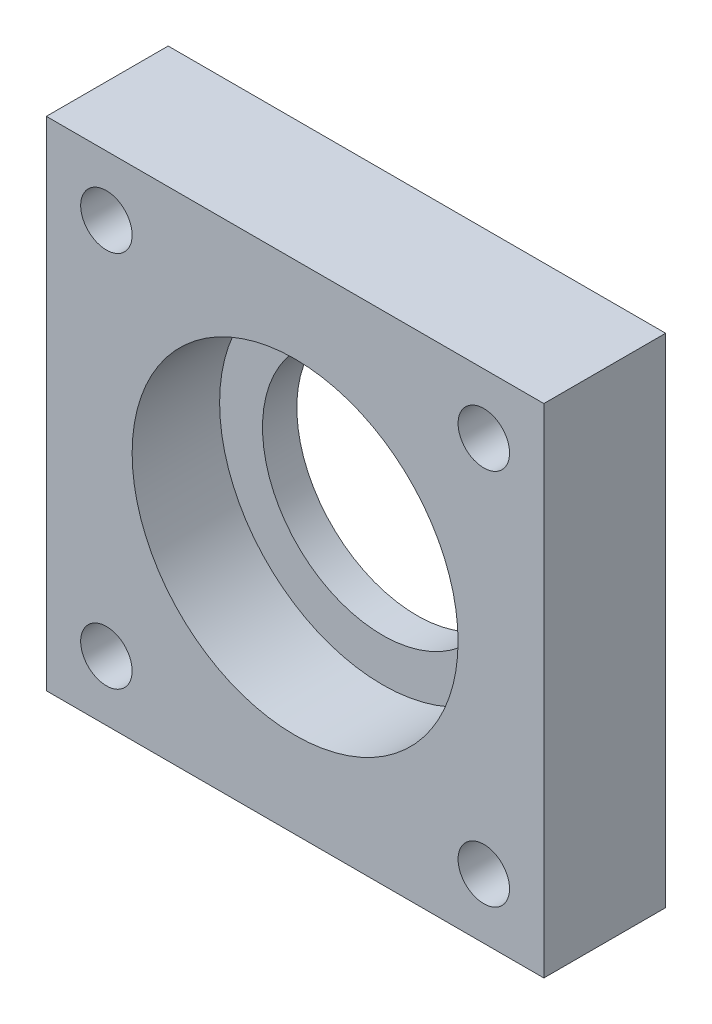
ISO-10303-21;
HEADER;
FILE_DESCRIPTION(('STEP AP214'),'2;1');
FILE_NAME('part.step','',(''),(''),'','','');
FILE_SCHEMA(('AUTOMOTIVE_DESIGN { 1 0 10303 214 1 1 1 1 }'));
ENDSEC;
DATA;
#1=APPLICATION_CONTEXT('core data for automotive mechanical design processes');
#2=APPLICATION_PROTOCOL_DEFINITION('international standard','automotive_design',2000,#1);
#3=PRODUCT_CONTEXT('',#1,'mechanical');
#4=PRODUCT('Part','Part','',(#3));
#5=PRODUCT_RELATED_PRODUCT_CATEGORY('part','',(#4));
#6=PRODUCT_DEFINITION_FORMATION('','',#4);
#7=PRODUCT_DEFINITION_CONTEXT('part definition',#1,'design');
#8=PRODUCT_DEFINITION('design','',#6,#7);
#9=PRODUCT_DEFINITION_SHAPE('','',#8);
#10=(LENGTH_UNIT() NAMED_UNIT(*) SI_UNIT(.MILLI.,.METRE.));
#11=(NAMED_UNIT(*) PLANE_ANGLE_UNIT() SI_UNIT($,.RADIAN.));
#12=(NAMED_UNIT(*) SI_UNIT($,.STERADIAN.) SOLID_ANGLE_UNIT());
#13=UNCERTAINTY_MEASURE_WITH_UNIT(LENGTH_MEASURE(1.E-05),#10,'distance_accuracy_value','');
#14=(GEOMETRIC_REPRESENTATION_CONTEXT(3) GLOBAL_UNCERTAINTY_ASSIGNED_CONTEXT((#13)) GLOBAL_UNIT_ASSIGNED_CONTEXT((#10,
#11,#12)) REPRESENTATION_CONTEXT('',''));
#15=CARTESIAN_POINT('',(0.,0.,0.));
#16=DIRECTION('',(0.,0.,1.));
#17=DIRECTION('',(1.,0.,0.));
#18=AXIS2_PLACEMENT_3D('',#15,#16,#17);
#19=CARTESIAN_POINT('',(0.,0.,-2.));
#20=DIRECTION('',(0.,0.,1.));
#21=DIRECTION('',(1.,0.,0.));
#22=AXIS2_PLACEMENT_3D('',#19,#20,#21);
#23=PLANE('',#22);
#24=DIRECTION('',(-0.918032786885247,0.396504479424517,0.));
#25=VECTOR('',#24,1.);
#26=CARTESIAN_POINT('',(-7.7233418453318,-17.8819695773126,-2.));
#27=LINE('',#26,#25);
#28=CARTESIAN_POINT('',(-15.8231617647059,-14.3836033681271,-2.));
#29=VERTEX_POINT('',#28);
#30=CARTESIAN_POINT('',(-18.6231617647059,-13.1742647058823,-2.));
#31=VERTEX_POINT('',#30);
#32=EDGE_CURVE('E58',#29,#31,#27,.T.);
#33=ORIENTED_EDGE('',*,*,#32,.T.);
#34=DIRECTION('',(-0.918032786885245,-0.396504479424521,0.));
#35=VECTOR('',#34,1.);
#36=CARTESIAN_POINT('',(1.86763121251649,-4.32415464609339,-2.));
#37=LINE('',#36,#35);
#38=CARTESIAN_POINT('',(-21.4231617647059,-14.3836033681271,-2.));
#39=VERTEX_POINT('',#38);
#40=EDGE_CURVE('E287',#31,#39,#37,.T.);
#41=ORIENTED_EDGE('',*,*,#40,.T.);
#42=DIRECTION('',(0.,-1.,0.));
#43=VECTOR('',#42,1.);
#44=CARTESIAN_POINT('',(-21.4231617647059,0.,-2.));
#45=LINE('',#44,#43);
#46=CARTESIAN_POINT('',(-21.4231617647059,-18.0649260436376,-2.));
#47=VERTEX_POINT('',#46);
#48=EDGE_CURVE('E315',#39,#47,#45,.T.);
#49=ORIENTED_EDGE('',*,*,#48,.T.);
#50=DIRECTION('',(-0.918032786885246,0.39650447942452,0.));
#51=VECTOR('',#50,1.);
#52=CARTESIAN_POINT('',(-9.94376693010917,-23.02295318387,-2.));
#53=LINE('',#52,#51);
#54=CARTESIAN_POINT('',(-18.6231617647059,-19.2742647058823,-2.));
#55=VERTEX_POINT('',#54);
#56=EDGE_CURVE('E312',#55,#47,#53,.T.);
#57=ORIENTED_EDGE('',*,*,#56,.F.);
#58=DIRECTION('',(-0.918032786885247,-0.396504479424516,0.));
#59=VECTOR('',#58,1.);
#60=CARTESIAN_POINT('',(4.08805629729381,-9.46513825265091,-2.));
#61=LINE('',#60,#59);
#62=CARTESIAN_POINT('',(-15.8231617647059,-18.0649260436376,-2.));
#63=VERTEX_POINT('',#62);
#64=EDGE_CURVE('E309',#63,#55,#61,.T.);
#65=ORIENTED_EDGE('',*,*,#64,.F.);
#66=DIRECTION('',(0.,-1.,0.));
#67=VECTOR('',#66,1.);
#68=CARTESIAN_POINT('',(-15.8231617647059,0.,-2.));
#69=LINE('',#68,#67);
#70=EDGE_CURVE('E305',#29,#63,#69,.T.);
#71=ORIENTED_EDGE('',*,*,#70,.F.);
#72=EDGE_LOOP('',(#33,#41,#49,#57,#65,#71));
#73=FACE_BOUND('',#72,.T.);
#74=DIRECTION('',(-0.918032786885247,0.396504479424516,0.));
#75=VECTOR('',#74,1.);
#76=CARTESIAN_POINT('',(3.74349627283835,8.66737324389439,-2.));
#77=LINE('',#76,#75);
#78=CARTESIAN_POINT('',(6.176838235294,7.6163966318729,-2.));
#79=VERTEX_POINT('',#78);
#80=CARTESIAN_POINT('',(3.376838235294,8.82573529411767,-2.));
#81=VERTEX_POINT('',#80);
#82=EDGE_CURVE('E275',#79,#81,#77,.T.);
#83=ORIENTED_EDGE('',*,*,#82,.T.);
#84=DIRECTION('',(-0.918032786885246,-0.39650447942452,0.));
#85=VECTOR('',#84,1.);
#86=CARTESIAN_POINT('',(-2.68171160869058,6.20900723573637,-2.));
#87=LINE('',#86,#85);
#88=CARTESIAN_POINT('',(0.576838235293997,7.61639663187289,-2.));
#89=VERTEX_POINT('',#88);
#90=EDGE_CURVE('E380',#81,#89,#87,.T.);
#91=ORIENTED_EDGE('',*,*,#90,.T.);
#92=DIRECTION('',(0.,-1.,0.));
#93=VECTOR('',#92,1.);
#94=CARTESIAN_POINT('',(0.576838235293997,0.,-2.));
#95=LINE('',#94,#93);
#96=CARTESIAN_POINT('',(0.576838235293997,3.93507395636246,-2.));
#97=VERTEX_POINT('',#96);
#98=EDGE_CURVE('E408',#89,#97,#95,.T.);
#99=ORIENTED_EDGE('',*,*,#98,.T.);
#100=DIRECTION('',(-0.918032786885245,0.39650447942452,0.));
#101=VECTOR('',#100,1.);
#102=CARTESIAN_POINT('',(1.52307118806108,3.52638963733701,-2.));
#103=LINE('',#102,#101);
#104=CARTESIAN_POINT('',(3.37683823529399,2.72573529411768,-2.));
#105=VERTEX_POINT('',#104);
#106=EDGE_CURVE('E405',#105,#97,#103,.T.);
#107=ORIENTED_EDGE('',*,*,#106,.F.);
#108=DIRECTION('',(-0.918032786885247,-0.396504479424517,0.));
#109=VECTOR('',#108,1.);
#110=CARTESIAN_POINT('',(-0.461286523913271,1.06802362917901,-2.));
#111=LINE('',#110,#109);
#112=CARTESIAN_POINT('',(6.176838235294,3.93507395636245,-2.));
#113=VERTEX_POINT('',#112);
#114=EDGE_CURVE('E402',#113,#105,#111,.T.);
#115=ORIENTED_EDGE('',*,*,#114,.F.);
#116=DIRECTION('',(0.,-1.,0.));
#117=VECTOR('',#116,1.);
#118=CARTESIAN_POINT('',(6.176838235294,0.,-2.));
#119=LINE('',#118,#117);
#120=EDGE_CURVE('E399',#79,#113,#119,.T.);
#121=ORIENTED_EDGE('',*,*,#120,.F.);
#122=EDGE_LOOP('',(#83,#91,#99,#107,#115,#121));
#123=FACE_BOUND('',#122,.T.);
#124=DIRECTION('',(0.,-1.,0.));
#125=VECTOR('',#124,1.);
#126=CARTESIAN_POINT('',(6.87683823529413,0.,-2.));
#127=LINE('',#126,#125);
#128=CARTESIAN_POINT('',(6.87683823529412,9.27573529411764,-2.));
#129=VERTEX_POINT('',#128);
#130=CARTESIAN_POINT('',(6.87683823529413,-19.7242647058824,-2.));
#131=VERTEX_POINT('',#130);
#132=EDGE_CURVE('E439',#129,#131,#127,.T.);
#133=ORIENTED_EDGE('',*,*,#132,.T.);
#134=DIRECTION('',(1.,0.,0.));
#135=VECTOR('',#134,1.);
#136=CARTESIAN_POINT('',(0.,-19.7242647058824,-2.));
#137=LINE('',#136,#135);
#138=CARTESIAN_POINT('',(-22.1231617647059,-19.7242647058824,-2.));
#139=VERTEX_POINT('',#138);
#140=EDGE_CURVE('E448',#139,#131,#137,.T.);
#141=ORIENTED_EDGE('',*,*,#140,.F.);
#142=DIRECTION('',(0.,-1.,0.));
#143=VECTOR('',#142,1.);
#144=CARTESIAN_POINT('',(-22.1231617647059,0.,-2.));
#145=LINE('',#144,#143);
#146=CARTESIAN_POINT('',(-22.1231617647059,9.27573529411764,-2.));
#147=VERTEX_POINT('',#146);
#148=EDGE_CURVE('E445',#147,#139,#145,.T.);
#149=ORIENTED_EDGE('',*,*,#148,.F.);
#150=DIRECTION('',(1.,0.,0.));
#151=VECTOR('',#150,1.);
#152=CARTESIAN_POINT('',(0.,9.27573529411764,-2.));
#153=LINE('',#152,#151);
#154=EDGE_CURVE('E442',#147,#129,#153,.T.);
#155=ORIENTED_EDGE('',*,*,#154,.T.);
#156=EDGE_LOOP('',(#133,#141,#149,#155));
#157=FACE_BOUND('',#156,.T.);
#158=CARTESIAN_POINT('',(-7.62316176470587,-5.22426470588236,-2.));
#159=DIRECTION('',(0.,0.,1.));
#160=DIRECTION('',(1.,0.,0.));
#161=AXIS2_PLACEMENT_3D('',#158,#159,#160);
#162=CIRCLE('',#161,7.);
#163=CARTESIAN_POINT('',(-0.623161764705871,-5.22426470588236,-2.));
#164=VERTEX_POINT('',#163);
#165=EDGE_CURVE('E451',#164,#164,#162,.T.);
#166=ORIENTED_EDGE('',*,*,#165,.T.);
#167=EDGE_LOOP('',(#166));
#168=FACE_BOUND('',#167,.T.);
#169=DIRECTION('',(-0.918032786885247,0.396504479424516,0.));
#170=VECTOR('',#169,1.);
#171=CARTESIAN_POINT('',(0.284748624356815,0.659282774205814,-2.));
#172=LINE('',#171,#170);
#173=CARTESIAN_POINT('',(-15.8231617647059,7.61639663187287,-2.));
#174=VERTEX_POINT('',#173);
#175=CARTESIAN_POINT('',(-18.6231617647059,8.82573529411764,-2.));
#176=VERTEX_POINT('',#175);
#177=EDGE_CURVE('E228',#174,#176,#172,.T.);
#178=ORIENTED_EDGE('',*,*,#177,.T.);
#179=DIRECTION('',(-0.918032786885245,-0.39650447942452,0.));
#180=VECTOR('',#179,1.);
#181=CARTESIAN_POINT('',(-6.14045925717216,14.217097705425,-2.));
#182=LINE('',#181,#180);
#183=CARTESIAN_POINT('',(-21.4231617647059,7.61639663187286,-2.));
#184=VERTEX_POINT('',#183);
#185=EDGE_CURVE('E270',#176,#184,#182,.T.);
#186=ORIENTED_EDGE('',*,*,#185,.T.);
#187=DIRECTION('',(0.,-1.,0.));
#188=VECTOR('',#187,1.);
#189=CARTESIAN_POINT('',(-21.4231617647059,0.,-2.));
#190=LINE('',#189,#188);
#191=CARTESIAN_POINT('',(-21.4231617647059,3.93507395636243,-2.));
#192=VERTEX_POINT('',#191);
#193=EDGE_CURVE('E267',#184,#192,#190,.T.);
#194=ORIENTED_EDGE('',*,*,#193,.T.);
#195=DIRECTION('',(-0.918032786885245,0.39650447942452,0.));
#196=VECTOR('',#195,1.);
#197=CARTESIAN_POINT('',(-1.93567646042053,-4.48170083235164,-2.));
#198=LINE('',#197,#196);
#199=CARTESIAN_POINT('',(-18.6231617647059,2.72573529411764,-2.));
#200=VERTEX_POINT('',#199);
#201=EDGE_CURVE('E264',#200,#192,#198,.T.);
#202=ORIENTED_EDGE('',*,*,#201,.F.);
#203=DIRECTION('',(-0.918032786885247,-0.396504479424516,0.));
#204=VECTOR('',#203,1.);
#205=CARTESIAN_POINT('',(-3.92003417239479,9.07611409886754,-2.));
#206=LINE('',#205,#204);
#207=CARTESIAN_POINT('',(-15.8231617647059,3.93507395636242,-2.));
#208=VERTEX_POINT('',#207);
#209=EDGE_CURVE('E261',#208,#200,#206,.T.);
#210=ORIENTED_EDGE('',*,*,#209,.F.);
#211=DIRECTION('',(0.,-1.,0.));
#212=VECTOR('',#211,1.);
#213=CARTESIAN_POINT('',(-15.8231617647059,0.,-2.));
#214=LINE('',#213,#212);
#215=EDGE_CURVE('E258',#174,#208,#214,.T.);
#216=ORIENTED_EDGE('',*,*,#215,.F.);
#217=EDGE_LOOP('',(#178,#186,#194,#202,#210,#216));
#218=FACE_BOUND('',#217,.T.);
#219=DIRECTION('',(-0.918032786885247,0.396504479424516,0.));
#220=VECTOR('',#219,1.);
#221=CARTESIAN_POINT('',(-4.26459419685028,-9.87387910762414,-2.));
#222=LINE('',#221,#220);
#223=CARTESIAN_POINT('',(6.17683823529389,-14.3836033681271,-2.));
#224=VERTEX_POINT('',#223);
#225=CARTESIAN_POINT('',(3.37683823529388,-13.1742647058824,-2.));
#226=VERTEX_POINT('',#225);
#227=EDGE_CURVE('E50',#224,#226,#222,.T.);
#228=ORIENTED_EDGE('',*,*,#227,.T.);
#229=DIRECTION('',(-0.918032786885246,-0.39650447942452,0.));
#230=VECTOR('',#229,1.);
#231=CARTESIAN_POINT('',(5.32637886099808,-12.332245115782,-2.));
#232=LINE('',#231,#230);
#233=CARTESIAN_POINT('',(0.576838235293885,-14.3836033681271,-2.));
#234=VERTEX_POINT('',#233);
#235=EDGE_CURVE('E334',#226,#234,#232,.T.);
#236=ORIENTED_EDGE('',*,*,#235,.T.);
#237=DIRECTION('',(0.,-1.,0.));
#238=VECTOR('',#237,1.);
#239=CARTESIAN_POINT('',(0.576838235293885,0.,-2.));
#240=LINE('',#239,#238);
#241=CARTESIAN_POINT('',(0.576838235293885,-18.0649260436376,-2.));
#242=VERTEX_POINT('',#241);
#243=EDGE_CURVE('E361',#234,#242,#240,.T.);
#244=ORIENTED_EDGE('',*,*,#243,.T.);
#245=DIRECTION('',(-0.918032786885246,0.39650447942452,0.));
#246=VECTOR('',#245,1.);
#247=CARTESIAN_POINT('',(-6.48501928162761,-15.0148627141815,-2.));
#248=LINE('',#247,#246);
#249=CARTESIAN_POINT('',(3.37683823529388,-19.2742647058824,-2.));
#250=VERTEX_POINT('',#249);
#251=EDGE_CURVE('E358',#250,#242,#248,.T.);
#252=ORIENTED_EDGE('',*,*,#251,.F.);
#253=DIRECTION('',(-0.918032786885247,-0.396504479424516,0.));
#254=VECTOR('',#253,1.);
#255=CARTESIAN_POINT('',(7.54680394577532,-17.4732287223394,-2.));
#256=LINE('',#255,#254);
#257=CARTESIAN_POINT('',(6.17683823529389,-18.0649260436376,-2.));
#258=VERTEX_POINT('',#257);
#259=EDGE_CURVE('E355',#258,#250,#256,.T.);
#260=ORIENTED_EDGE('',*,*,#259,.F.);
#261=DIRECTION('',(0.,-1.,0.));
#262=VECTOR('',#261,1.);
#263=CARTESIAN_POINT('',(6.17683823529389,0.,-2.));
#264=LINE('',#263,#262);
#265=EDGE_CURVE('E352',#224,#258,#264,.T.);
#266=ORIENTED_EDGE('',*,*,#265,.F.);
#267=EDGE_LOOP('',(#228,#236,#244,#252,#260,#266));
#268=FACE_BOUND('',#267,.T.);
#269=ADVANCED_FACE('F35',(#73,#123,#157,#168,#218,#268),#23,.F.);
#270=CARTESIAN_POINT('',(-18.6231617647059,5.77573529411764,-6.24264068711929));
#271=DIRECTION('',(0.,0.,1.));
#272=DIRECTION('',(1.,0.,0.));
#273=AXIS2_PLACEMENT_3D('',#270,#271,#272);
#274=CYLINDRICAL_SURFACE('',#273,1.5);
#275=CARTESIAN_POINT('',(-18.6231617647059,5.77573529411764,5.1));
#276=DIRECTION('',(0.,0.,1.));
#277=DIRECTION('',(1.,0.,0.));
#278=AXIS2_PLACEMENT_3D('',#275,#276,#277);
#279=CIRCLE('',#278,1.5);
#280=CARTESIAN_POINT('',(-17.1231617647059,5.77573529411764,5.1));
#281=VERTEX_POINT('',#280);
#282=EDGE_CURVE('E430',#281,#281,#279,.T.);
#283=ORIENTED_EDGE('',*,*,#282,.T.);
#284=EDGE_LOOP('',(#283));
#285=FACE_BOUND('',#284,.T.);
#286=CARTESIAN_POINT('',(-18.6231617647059,5.77573529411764,0.));
#287=DIRECTION('',(0.,0.,-1.));
#288=DIRECTION('',(-1.,0.,0.));
#289=AXIS2_PLACEMENT_3D('',#286,#287,#288);
#290=CIRCLE('',#289,1.5);
#291=CARTESIAN_POINT('',(-20.1231617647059,5.77573529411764,0.));
#292=VERTEX_POINT('',#291);
#293=EDGE_CURVE('E242',#292,#292,#290,.F.);
#294=ORIENTED_EDGE('',*,*,#293,.F.);
#295=EDGE_LOOP('',(#294));
#296=FACE_BOUND('',#295,.T.);
#297=ADVANCED_FACE('F508',(#285,#296),#274,.F.);
#298=CARTESIAN_POINT('',(3.376838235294,5.77573529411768,-6.24264068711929));
#299=DIRECTION('',(0.,0.,1.));
#300=DIRECTION('',(1.,0.,0.));
#301=AXIS2_PLACEMENT_3D('',#298,#299,#300);
#302=CYLINDRICAL_SURFACE('',#301,1.5);
#303=CARTESIAN_POINT('',(3.376838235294,5.77573529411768,5.1));
#304=DIRECTION('',(0.,0.,1.));
#305=DIRECTION('',(1.,0.,0.));
#306=AXIS2_PLACEMENT_3D('',#303,#304,#305);
#307=CIRCLE('',#306,1.5);
#308=CARTESIAN_POINT('',(4.876838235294,5.77573529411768,5.1));
#309=VERTEX_POINT('',#308);
#310=EDGE_CURVE('E427',#309,#309,#307,.T.);
#311=ORIENTED_EDGE('',*,*,#310,.T.);
#312=EDGE_LOOP('',(#311));
#313=FACE_BOUND('',#312,.T.);
#314=CARTESIAN_POINT('',(3.376838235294,5.77573529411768,0.));
#315=DIRECTION('',(0.,0.,-1.));
#316=DIRECTION('',(-1.,0.,0.));
#317=AXIS2_PLACEMENT_3D('',#314,#315,#316);
#318=CIRCLE('',#317,1.5);
#319=CARTESIAN_POINT('',(1.876838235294,5.77573529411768,0.));
#320=VERTEX_POINT('',#319);
#321=EDGE_CURVE('E376',#320,#320,#318,.F.);
#322=ORIENTED_EDGE('',*,*,#321,.F.);
#323=EDGE_LOOP('',(#322));
#324=FACE_BOUND('',#323,.T.);
#325=ADVANCED_FACE('F514',(#313,#324),#302,.F.);
#326=CARTESIAN_POINT('',(3.37683823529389,-16.2242647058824,-6.24264068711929));
#327=DIRECTION('',(0.,0.,1.));
#328=DIRECTION('',(1.,0.,0.));
#329=AXIS2_PLACEMENT_3D('',#326,#327,#328);
#330=CYLINDRICAL_SURFACE('',#329,1.5);
#331=CARTESIAN_POINT('',(3.37683823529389,-16.2242647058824,5.1));
#332=DIRECTION('',(0.,0.,1.));
#333=DIRECTION('',(1.,0.,0.));
#334=AXIS2_PLACEMENT_3D('',#331,#332,#333);
#335=CIRCLE('',#334,1.5);
#336=CARTESIAN_POINT('',(4.87683823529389,-16.2242647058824,5.1));
#337=VERTEX_POINT('',#336);
#338=EDGE_CURVE('E431',#337,#337,#335,.T.);
#339=ORIENTED_EDGE('',*,*,#338,.T.);
#340=EDGE_LOOP('',(#339));
#341=FACE_BOUND('',#340,.T.);
#342=CARTESIAN_POINT('',(3.37683823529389,-16.2242647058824,0.));
#343=DIRECTION('',(0.,0.,-1.));
#344=DIRECTION('',(-1.,0.,0.));
#345=AXIS2_PLACEMENT_3D('',#342,#343,#344);
#346=CIRCLE('',#345,1.5);
#347=CARTESIAN_POINT('',(1.87683823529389,-16.2242647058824,0.));
#348=VERTEX_POINT('',#347);
#349=EDGE_CURVE('E330',#348,#348,#346,.F.);
#350=ORIENTED_EDGE('',*,*,#349,.F.);
#351=EDGE_LOOP('',(#350));
#352=FACE_BOUND('',#351,.T.);
#353=ADVANCED_FACE('F504',(#341,#352),#330,.F.);
#354=CARTESIAN_POINT('',(-18.6231617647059,-16.2242647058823,-6.24264068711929));
#355=DIRECTION('',(0.,0.,1.));
#356=DIRECTION('',(1.,0.,0.));
#357=AXIS2_PLACEMENT_3D('',#354,#355,#356);
#358=CYLINDRICAL_SURFACE('',#357,1.5);
#359=CARTESIAN_POINT('',(-18.6231617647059,-16.2242647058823,5.1));
#360=DIRECTION('',(0.,0.,1.));
#361=DIRECTION('',(1.,0.,0.));
#362=AXIS2_PLACEMENT_3D('',#359,#360,#361);
#363=CIRCLE('',#362,1.5);
#364=CARTESIAN_POINT('',(-17.1231617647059,-16.2242647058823,5.1));
#365=VERTEX_POINT('',#364);
#366=EDGE_CURVE('E416',#365,#365,#363,.T.);
#367=ORIENTED_EDGE('',*,*,#366,.T.);
#368=EDGE_LOOP('',(#367));
#369=FACE_BOUND('',#368,.T.);
#370=CARTESIAN_POINT('',(-18.6231617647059,-16.2242647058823,0.));
#371=DIRECTION('',(0.,0.,-1.));
#372=DIRECTION('',(-1.,0.,0.));
#373=AXIS2_PLACEMENT_3D('',#370,#371,#372);
#374=CIRCLE('',#373,1.5);
#375=CARTESIAN_POINT('',(-20.1231617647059,-16.2242647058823,0.));
#376=VERTEX_POINT('',#375);
#377=EDGE_CURVE('E283',#376,#376,#374,.F.);
#378=ORIENTED_EDGE('',*,*,#377,.F.);
#379=EDGE_LOOP('',(#378));
#380=FACE_BOUND('',#379,.T.);
#381=ADVANCED_FACE('F498',(#369,#380),#358,.F.);
#382=CARTESIAN_POINT('',(6.87683823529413,0.,5.1));
#383=DIRECTION('',(1.,0.,0.));
#384=DIRECTION('',(0.,1.,0.));
#385=AXIS2_PLACEMENT_3D('',#382,#383,#384);
#386=PLANE('',#385);
#387=DIRECTION('',(0.,0.,-1.));
#388=VECTOR('',#387,1.);
#389=CARTESIAN_POINT('',(6.87683823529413,-19.7242647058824,5.1));
#390=LINE('',#389,#388);
#391=CARTESIAN_POINT('',(6.87683823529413,-19.7242647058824,5.1));
#392=VERTEX_POINT('',#391);
#393=EDGE_CURVE('E471',#392,#131,#390,.T.);
#394=ORIENTED_EDGE('',*,*,#393,.T.);
#395=ORIENTED_EDGE('',*,*,#132,.F.);
#396=DIRECTION('',(0.,0.,-1.));
#397=VECTOR('',#396,1.);
#398=CARTESIAN_POINT('',(6.87683823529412,9.27573529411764,5.1));
#399=LINE('',#398,#397);
#400=CARTESIAN_POINT('',(6.87683823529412,9.27573529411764,5.1));
#401=VERTEX_POINT('',#400);
#402=EDGE_CURVE('E11',#401,#129,#399,.T.);
#403=ORIENTED_EDGE('',*,*,#402,.F.);
#404=DIRECTION('',(0.,-1.,0.));
#405=VECTOR('',#404,1.);
#406=CARTESIAN_POINT('',(6.87683823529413,0.,5.1));
#407=LINE('',#406,#405);
#408=EDGE_CURVE('E460',#401,#392,#407,.T.);
#409=ORIENTED_EDGE('',*,*,#408,.T.);
#410=EDGE_LOOP('',(#394,#395,#403,#409));
#411=FACE_BOUND('',#410,.T.);
#412=ADVANCED_FACE('F496',(#411),#386,.T.);
#413=CARTESIAN_POINT('',(0.,9.27573529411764,5.1));
#414=DIRECTION('',(0.,1.,0.));
#415=DIRECTION('',(0.,0.,1.));
#416=AXIS2_PLACEMENT_3D('',#413,#414,#415);
#417=PLANE('',#416);
#418=ORIENTED_EDGE('',*,*,#402,.T.);
#419=ORIENTED_EDGE('',*,*,#154,.F.);
#420=DIRECTION('',(0.,0.,-1.));
#421=VECTOR('',#420,1.);
#422=CARTESIAN_POINT('',(-22.1231617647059,9.27573529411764,5.1));
#423=LINE('',#422,#421);
#424=CARTESIAN_POINT('',(-22.1231617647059,9.27573529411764,5.1));
#425=VERTEX_POINT('',#424);
#426=EDGE_CURVE('E43',#425,#147,#423,.T.);
#427=ORIENTED_EDGE('',*,*,#426,.F.);
#428=DIRECTION('',(1.,0.,0.));
#429=VECTOR('',#428,1.);
#430=CARTESIAN_POINT('',(0.,9.27573529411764,5.1));
#431=LINE('',#430,#429);
#432=EDGE_CURVE('E463',#425,#401,#431,.T.);
#433=ORIENTED_EDGE('',*,*,#432,.T.);
#434=EDGE_LOOP('',(#418,#419,#427,#433));
#435=FACE_BOUND('',#434,.T.);
#436=ADVANCED_FACE('F485',(#435),#417,.T.);
#437=CARTESIAN_POINT('',(-22.1231617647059,0.,5.1));
#438=DIRECTION('',(1.,0.,0.));
#439=DIRECTION('',(0.,1.,0.));
#440=AXIS2_PLACEMENT_3D('',#437,#438,#439);
#441=PLANE('',#440);
#442=ORIENTED_EDGE('',*,*,#426,.T.);
#443=ORIENTED_EDGE('',*,*,#148,.T.);
#444=DIRECTION('',(0.,0.,-1.));
#445=VECTOR('',#444,1.);
#446=CARTESIAN_POINT('',(-22.1231617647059,-19.7242647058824,5.1));
#447=LINE('',#446,#445);
#448=CARTESIAN_POINT('',(-22.1231617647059,-19.7242647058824,5.1));
#449=VERTEX_POINT('',#448);
#450=EDGE_CURVE('E475',#449,#139,#447,.T.);
#451=ORIENTED_EDGE('',*,*,#450,.F.);
#452=DIRECTION('',(0.,-1.,0.));
#453=VECTOR('',#452,1.);
#454=CARTESIAN_POINT('',(-22.1231617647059,0.,5.1));
#455=LINE('',#454,#453);
#456=EDGE_CURVE('E466',#425,#449,#455,.T.);
#457=ORIENTED_EDGE('',*,*,#456,.F.);
#458=EDGE_LOOP('',(#442,#443,#451,#457));
#459=FACE_BOUND('',#458,.T.);
#460=ADVANCED_FACE('F479',(#459),#441,.F.);
#461=CARTESIAN_POINT('',(-7.62316176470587,-5.22426470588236,5.1));
#462=DIRECTION('',(0.,0.,-1.));
#463=DIRECTION('',(-1.,0.,0.));
#464=AXIS2_PLACEMENT_3D('',#461,#462,#463);
#465=CYLINDRICAL_SURFACE('',#464,9.5);
#466=CARTESIAN_POINT('',(-7.62316176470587,-5.22426470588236,5.1));
#467=DIRECTION('',(0.,0.,1.));
#468=DIRECTION('',(1.,0.,0.));
#469=AXIS2_PLACEMENT_3D('',#466,#467,#468);
#470=CIRCLE('',#469,9.5);
#471=CARTESIAN_POINT('',(1.87683823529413,-5.22426470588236,5.1));
#472=VERTEX_POINT('',#471);
#473=EDGE_CURVE('E457',#472,#472,#470,.T.);
#474=ORIENTED_EDGE('',*,*,#473,.T.);
#475=EDGE_LOOP('',(#474));
#476=FACE_BOUND('',#475,.T.);
#477=CARTESIAN_POINT('',(-7.62316176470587,-5.22426470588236,0.));
#478=DIRECTION('',(0.,0.,1.));
#479=DIRECTION('',(1.,0.,0.));
#480=AXIS2_PLACEMENT_3D('',#477,#478,#479);
#481=CIRCLE('',#480,9.5);
#482=CARTESIAN_POINT('',(1.87683823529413,-5.22426470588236,0.));
#483=VERTEX_POINT('',#482);
#484=EDGE_CURVE('E454',#483,#483,#481,.T.);
#485=ORIENTED_EDGE('',*,*,#484,.F.);
#486=EDGE_LOOP('',(#485));
#487=FACE_BOUND('',#486,.T.);
#488=ADVANCED_FACE('F37',(#476,#487),#465,.F.);
#489=CARTESIAN_POINT('',(0.,-19.7242647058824,5.1));
#490=DIRECTION('',(0.,1.,0.));
#491=DIRECTION('',(0.,0.,1.));
#492=AXIS2_PLACEMENT_3D('',#489,#490,#491);
#493=PLANE('',#492);
#494=ORIENTED_EDGE('',*,*,#450,.T.);
#495=ORIENTED_EDGE('',*,*,#140,.T.);
#496=ORIENTED_EDGE('',*,*,#393,.F.);
#497=DIRECTION('',(1.,0.,0.));
#498=VECTOR('',#497,1.);
#499=CARTESIAN_POINT('',(0.,-19.7242647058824,5.1));
#500=LINE('',#499,#498);
#501=EDGE_CURVE('E469',#449,#392,#500,.T.);
#502=ORIENTED_EDGE('',*,*,#501,.F.);
#503=EDGE_LOOP('',(#494,#495,#496,#502));
#504=FACE_BOUND('',#503,.T.);
#505=ADVANCED_FACE('F491',(#504),#493,.F.);
#506=CARTESIAN_POINT('',(0.,0.,5.1));
#507=DIRECTION('',(0.,0.,1.));
#508=DIRECTION('',(1.,0.,0.));
#509=AXIS2_PLACEMENT_3D('',#506,#507,#508);
#510=PLANE('',#509);
#511=ORIENTED_EDGE('',*,*,#366,.F.);
#512=EDGE_LOOP('',(#511));
#513=FACE_BOUND('',#512,.T.);
#514=ORIENTED_EDGE('',*,*,#338,.F.);
#515=EDGE_LOOP('',(#514));
#516=FACE_BOUND('',#515,.T.);
#517=ORIENTED_EDGE('',*,*,#310,.F.);
#518=EDGE_LOOP('',(#517));
#519=FACE_BOUND('',#518,.T.);
#520=ORIENTED_EDGE('',*,*,#282,.F.);
#521=EDGE_LOOP('',(#520));
#522=FACE_BOUND('',#521,.T.);
#523=ORIENTED_EDGE('',*,*,#473,.F.);
#524=EDGE_LOOP('',(#523));
#525=FACE_BOUND('',#524,.T.);
#526=ORIENTED_EDGE('',*,*,#408,.F.);
#527=ORIENTED_EDGE('',*,*,#432,.F.);
#528=ORIENTED_EDGE('',*,*,#456,.T.);
#529=ORIENTED_EDGE('',*,*,#501,.T.);
#530=EDGE_LOOP('',(#526,#527,#528,#529));
#531=FACE_BOUND('',#530,.T.);
#532=ADVANCED_FACE('F494',(#513,#516,#519,#522,#525,#531),#510,.T.);
#533=CARTESIAN_POINT('',(0.,0.,0.));
#534=DIRECTION('',(0.,0.,1.));
#535=DIRECTION('',(1.,0.,0.));
#536=AXIS2_PLACEMENT_3D('',#533,#534,#535);
#537=PLANE('',#536);
#538=CARTESIAN_POINT('',(-7.62316176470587,-5.22426470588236,0.));
#539=DIRECTION('',(0.,0.,1.));
#540=DIRECTION('',(1.,0.,0.));
#541=AXIS2_PLACEMENT_3D('',#538,#539,#540);
#542=CIRCLE('',#541,7.);
#543=CARTESIAN_POINT('',(-0.623161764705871,-5.22426470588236,0.));
#544=VERTEX_POINT('',#543);
#545=EDGE_CURVE('E438',#544,#544,#542,.T.);
#546=ORIENTED_EDGE('',*,*,#545,.F.);
#547=EDGE_LOOP('',(#546));
#548=FACE_BOUND('',#547,.T.);
#549=ORIENTED_EDGE('',*,*,#484,.T.);
#550=EDGE_LOOP('',(#549));
#551=FACE_BOUND('',#550,.T.);
#552=ADVANCED_FACE('F519',(#548,#551),#537,.T.);
#553=CARTESIAN_POINT('',(-7.62316176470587,-5.22426470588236,-2.));
#554=DIRECTION('',(0.,0.,1.));
#555=DIRECTION('',(1.,0.,0.));
#556=AXIS2_PLACEMENT_3D('',#553,#554,#555);
#557=CYLINDRICAL_SURFACE('',#556,7.);
#558=ORIENTED_EDGE('',*,*,#165,.F.);
#559=EDGE_LOOP('',(#558));
#560=FACE_BOUND('',#559,.T.);
#561=ORIENTED_EDGE('',*,*,#545,.T.);
#562=EDGE_LOOP('',(#561));
#563=FACE_BOUND('',#562,.T.);
#564=ADVANCED_FACE('F522',(#560,#563),#557,.F.);
#565=CARTESIAN_POINT('',(-7.7233418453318,-17.8819695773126,0.));
#566=DIRECTION('',(-0.396504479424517,-0.918032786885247,0.));
#567=DIRECTION('',(0.918032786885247,-0.396504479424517,0.));
#568=AXIS2_PLACEMENT_3D('',#565,#566,#567);
#569=PLANE('',#568);
#570=ORIENTED_EDGE('',*,*,#32,.F.);
#571=DIRECTION('',(0.,0.,-1.));
#572=VECTOR('',#571,1.);
#573=CARTESIAN_POINT('',(-15.8231617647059,-14.3836033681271,0.));
#574=LINE('',#573,#572);
#575=CARTESIAN_POINT('',(-15.8231617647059,-14.3836033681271,0.));
#576=VERTEX_POINT('',#575);
#577=EDGE_CURVE('E303',#576,#29,#574,.T.);
#578=ORIENTED_EDGE('',*,*,#577,.F.);
#579=DIRECTION('',(-0.918032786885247,0.396504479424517,0.));
#580=VECTOR('',#579,1.);
#581=CARTESIAN_POINT('',(-7.7233418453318,-17.8819695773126,0.));
#582=LINE('',#581,#580);
#583=CARTESIAN_POINT('',(-18.6231617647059,-13.1742647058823,0.));
#584=VERTEX_POINT('',#583);
#585=EDGE_CURVE('E286',#576,#584,#582,.T.);
#586=ORIENTED_EDGE('',*,*,#585,.T.);
#587=DIRECTION('',(0.,0.,-1.));
#588=VECTOR('',#587,1.);
#589=CARTESIAN_POINT('',(-18.6231617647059,-13.1742647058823,0.));
#590=LINE('',#589,#588);
#591=EDGE_CURVE('E259',#584,#31,#590,.T.);
#592=ORIENTED_EDGE('',*,*,#591,.T.);
#593=EDGE_LOOP('',(#570,#578,#586,#592));
#594=FACE_BOUND('',#593,.T.);
#595=ADVANCED_FACE('F526',(#594),#569,.T.);
#596=CARTESIAN_POINT('',(1.86763121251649,-4.32415464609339,0.));
#597=DIRECTION('',(0.396504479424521,-0.918032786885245,0.));
#598=DIRECTION('',(0.918032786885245,0.396504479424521,0.));
#599=AXIS2_PLACEMENT_3D('',#596,#597,#598);
#600=PLANE('',#599);
#601=ORIENTED_EDGE('',*,*,#40,.F.);
#602=ORIENTED_EDGE('',*,*,#591,.F.);
#603=DIRECTION('',(-0.918032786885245,-0.396504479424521,0.));
#604=VECTOR('',#603,1.);
#605=CARTESIAN_POINT('',(1.86763121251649,-4.32415464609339,0.));
#606=LINE('',#605,#604);
#607=CARTESIAN_POINT('',(-21.4231617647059,-14.3836033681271,0.));
#608=VERTEX_POINT('',#607);
#609=EDGE_CURVE('E301',#584,#608,#606,.T.);
#610=ORIENTED_EDGE('',*,*,#609,.T.);
#611=DIRECTION('',(0.,0.,-1.));
#612=VECTOR('',#611,1.);
#613=CARTESIAN_POINT('',(-21.4231617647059,-14.3836033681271,0.));
#614=LINE('',#613,#612);
#615=EDGE_CURVE('E321',#608,#39,#614,.T.);
#616=ORIENTED_EDGE('',*,*,#615,.T.);
#617=EDGE_LOOP('',(#601,#602,#610,#616));
#618=FACE_BOUND('',#617,.T.);
#619=ADVANCED_FACE('F567',(#618),#600,.T.);
#620=CARTESIAN_POINT('',(-21.4231617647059,0.,0.));
#621=DIRECTION('',(1.,0.,0.));
#622=DIRECTION('',(0.,0.,-1.));
#623=AXIS2_PLACEMENT_3D('',#620,#621,#622);
#624=PLANE('',#623);
#625=ORIENTED_EDGE('',*,*,#48,.F.);
#626=ORIENTED_EDGE('',*,*,#615,.F.);
#627=DIRECTION('',(0.,-1.,0.));
#628=VECTOR('',#627,1.);
#629=CARTESIAN_POINT('',(-21.4231617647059,0.,0.));
#630=LINE('',#629,#628);
#631=CARTESIAN_POINT('',(-21.4231617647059,-18.0649260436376,0.));
#632=VERTEX_POINT('',#631);
#633=EDGE_CURVE('E299',#608,#632,#630,.T.);
#634=ORIENTED_EDGE('',*,*,#633,.T.);
#635=DIRECTION('',(0.,0.,-1.));
#636=VECTOR('',#635,1.);
#637=CARTESIAN_POINT('',(-21.4231617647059,-18.0649260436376,0.));
#638=LINE('',#637,#636);
#639=EDGE_CURVE('E323',#632,#47,#638,.T.);
#640=ORIENTED_EDGE('',*,*,#639,.T.);
#641=EDGE_LOOP('',(#625,#626,#634,#640));
#642=FACE_BOUND('',#641,.T.);
#643=ADVANCED_FACE('F575',(#642),#624,.T.);
#644=CARTESIAN_POINT('',(-9.94376693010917,-23.02295318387,0.));
#645=DIRECTION('',(-0.39650447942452,-0.918032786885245,0.));
#646=DIRECTION('',(0.918032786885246,-0.39650447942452,0.));
#647=AXIS2_PLACEMENT_3D('',#644,#645,#646);
#648=PLANE('',#647);
#649=ORIENTED_EDGE('',*,*,#56,.T.);
#650=ORIENTED_EDGE('',*,*,#639,.F.);
#651=DIRECTION('',(-0.918032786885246,0.39650447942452,0.));
#652=VECTOR('',#651,1.);
#653=CARTESIAN_POINT('',(-9.94376693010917,-23.02295318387,0.));
#654=LINE('',#653,#652);
#655=CARTESIAN_POINT('',(-18.6231617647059,-19.2742647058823,0.));
#656=VERTEX_POINT('',#655);
#657=EDGE_CURVE('E296',#656,#632,#654,.T.);
#658=ORIENTED_EDGE('',*,*,#657,.F.);
#659=DIRECTION('',(0.,0.,-1.));
#660=VECTOR('',#659,1.);
#661=CARTESIAN_POINT('',(-18.6231617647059,-19.2742647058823,0.));
#662=LINE('',#661,#660);
#663=EDGE_CURVE('E325',#656,#55,#662,.T.);
#664=ORIENTED_EDGE('',*,*,#663,.T.);
#665=EDGE_LOOP('',(#649,#650,#658,#664));
#666=FACE_BOUND('',#665,.T.);
#667=ADVANCED_FACE('F583',(#666),#648,.F.);
#668=CARTESIAN_POINT('',(4.08805629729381,-9.46513825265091,0.));
#669=DIRECTION('',(0.396504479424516,-0.918032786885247,0.));
#670=DIRECTION('',(0.918032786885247,0.396504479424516,0.));
#671=AXIS2_PLACEMENT_3D('',#668,#669,#670);
#672=PLANE('',#671);
#673=ORIENTED_EDGE('',*,*,#64,.T.);
#674=ORIENTED_EDGE('',*,*,#663,.F.);
#675=DIRECTION('',(-0.918032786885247,-0.396504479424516,0.));
#676=VECTOR('',#675,1.);
#677=CARTESIAN_POINT('',(4.08805629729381,-9.46513825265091,0.));
#678=LINE('',#677,#676);
#679=CARTESIAN_POINT('',(-15.8231617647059,-18.0649260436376,0.));
#680=VERTEX_POINT('',#679);
#681=EDGE_CURVE('E293',#680,#656,#678,.T.);
#682=ORIENTED_EDGE('',*,*,#681,.F.);
#683=DIRECTION('',(0.,0.,-1.));
#684=VECTOR('',#683,1.);
#685=CARTESIAN_POINT('',(-15.8231617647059,-18.0649260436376,0.));
#686=LINE('',#685,#684);
#687=EDGE_CURVE('E327',#680,#63,#686,.T.);
#688=ORIENTED_EDGE('',*,*,#687,.T.);
#689=EDGE_LOOP('',(#673,#674,#682,#688));
#690=FACE_BOUND('',#689,.T.);
#691=ADVANCED_FACE('F591',(#690),#672,.F.);
#692=CARTESIAN_POINT('',(-15.8231617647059,0.,0.));
#693=DIRECTION('',(1.,0.,0.));
#694=DIRECTION('',(0.,0.,-1.));
#695=AXIS2_PLACEMENT_3D('',#692,#693,#694);
#696=PLANE('',#695);
#697=ORIENTED_EDGE('',*,*,#70,.T.);
#698=ORIENTED_EDGE('',*,*,#687,.F.);
#699=DIRECTION('',(0.,-1.,0.));
#700=VECTOR('',#699,1.);
#701=CARTESIAN_POINT('',(-15.8231617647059,0.,0.));
#702=LINE('',#701,#700);
#703=EDGE_CURVE('E290',#576,#680,#702,.T.);
#704=ORIENTED_EDGE('',*,*,#703,.F.);
#705=ORIENTED_EDGE('',*,*,#577,.T.);
#706=EDGE_LOOP('',(#697,#698,#704,#705));
#707=FACE_BOUND('',#706,.T.);
#708=ADVANCED_FACE('F599',(#707),#696,.F.);
#709=CARTESIAN_POINT('',(0.,0.,0.));
#710=DIRECTION('',(0.,0.,-1.));
#711=DIRECTION('',(-1.,0.,0.));
#712=AXIS2_PLACEMENT_3D('',#709,#710,#711);
#713=PLANE('',#712);
#714=ORIENTED_EDGE('',*,*,#377,.T.);
#715=EDGE_LOOP('',(#714));
#716=FACE_BOUND('',#715,.T.);
#717=ORIENTED_EDGE('',*,*,#585,.F.);
#718=ORIENTED_EDGE('',*,*,#703,.T.);
#719=ORIENTED_EDGE('',*,*,#681,.T.);
#720=ORIENTED_EDGE('',*,*,#657,.T.);
#721=ORIENTED_EDGE('',*,*,#633,.F.);
#722=ORIENTED_EDGE('',*,*,#609,.F.);
#723=EDGE_LOOP('',(#717,#718,#719,#720,#721,#722));
#724=FACE_BOUND('',#723,.T.);
#725=ADVANCED_FACE('F607',(#716,#724),#713,.T.);
#726=CARTESIAN_POINT('',(-4.26459419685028,-9.87387910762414,0.));
#727=DIRECTION('',(-0.396504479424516,-0.918032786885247,0.));
#728=DIRECTION('',(0.918032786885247,-0.396504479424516,0.));
#729=AXIS2_PLACEMENT_3D('',#726,#727,#728);
#730=PLANE('',#729);
#731=ORIENTED_EDGE('',*,*,#227,.F.);
#732=DIRECTION('',(0.,0.,-1.));
#733=VECTOR('',#732,1.);
#734=CARTESIAN_POINT('',(6.17683823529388,-14.3836033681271,0.));
#735=LINE('',#734,#733);
#736=CARTESIAN_POINT('',(6.17683823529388,-14.3836033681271,0.));
#737=VERTEX_POINT('',#736);
#738=EDGE_CURVE('E350',#737,#224,#735,.T.);
#739=ORIENTED_EDGE('',*,*,#738,.F.);
#740=DIRECTION('',(-0.918032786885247,0.396504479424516,0.));
#741=VECTOR('',#740,1.);
#742=CARTESIAN_POINT('',(-4.26459419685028,-9.87387910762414,0.));
#743=LINE('',#742,#741);
#744=CARTESIAN_POINT('',(3.37683823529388,-13.1742647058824,0.));
#745=VERTEX_POINT('',#744);
#746=EDGE_CURVE('E333',#737,#745,#743,.T.);
#747=ORIENTED_EDGE('',*,*,#746,.T.);
#748=DIRECTION('',(0.,0.,-1.));
#749=VECTOR('',#748,1.);
#750=CARTESIAN_POINT('',(3.37683823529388,-13.1742647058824,0.));
#751=LINE('',#750,#749);
#752=EDGE_CURVE('E306',#745,#226,#751,.T.);
#753=ORIENTED_EDGE('',*,*,#752,.T.);
#754=EDGE_LOOP('',(#731,#739,#747,#753));
#755=FACE_BOUND('',#754,.T.);
#756=ADVANCED_FACE('F615',(#755),#730,.T.);
#757=CARTESIAN_POINT('',(5.32637886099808,-12.332245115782,0.));
#758=DIRECTION('',(0.39650447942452,-0.918032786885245,0.));
#759=DIRECTION('',(0.918032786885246,0.39650447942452,0.));
#760=AXIS2_PLACEMENT_3D('',#757,#758,#759);
#761=PLANE('',#760);
#762=ORIENTED_EDGE('',*,*,#235,.F.);
#763=ORIENTED_EDGE('',*,*,#752,.F.);
#764=DIRECTION('',(-0.918032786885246,-0.39650447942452,0.));
#765=VECTOR('',#764,1.);
#766=CARTESIAN_POINT('',(5.32637886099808,-12.332245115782,0.));
#767=LINE('',#766,#765);
#768=CARTESIAN_POINT('',(0.576838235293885,-14.3836033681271,0.));
#769=VERTEX_POINT('',#768);
#770=EDGE_CURVE('E348',#745,#769,#767,.T.);
#771=ORIENTED_EDGE('',*,*,#770,.T.);
#772=DIRECTION('',(0.,0.,-1.));
#773=VECTOR('',#772,1.);
#774=CARTESIAN_POINT('',(0.576838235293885,-14.3836033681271,0.));
#775=LINE('',#774,#773);
#776=EDGE_CURVE('E367',#769,#234,#775,.T.);
#777=ORIENTED_EDGE('',*,*,#776,.T.);
#778=EDGE_LOOP('',(#762,#763,#771,#777));
#779=FACE_BOUND('',#778,.T.);
#780=ADVANCED_FACE('F623',(#779),#761,.T.);
#781=CARTESIAN_POINT('',(0.576838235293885,0.,0.));
#782=DIRECTION('',(1.,0.,0.));
#783=DIRECTION('',(0.,0.,-1.));
#784=AXIS2_PLACEMENT_3D('',#781,#782,#783);
#785=PLANE('',#784);
#786=ORIENTED_EDGE('',*,*,#243,.F.);
#787=ORIENTED_EDGE('',*,*,#776,.F.);
#788=DIRECTION('',(0.,-1.,0.));
#789=VECTOR('',#788,1.);
#790=CARTESIAN_POINT('',(0.576838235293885,0.,0.));
#791=LINE('',#790,#789);
#792=CARTESIAN_POINT('',(0.576838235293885,-18.0649260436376,0.));
#793=VERTEX_POINT('',#792);
#794=EDGE_CURVE('E346',#769,#793,#791,.T.);
#795=ORIENTED_EDGE('',*,*,#794,.T.);
#796=DIRECTION('',(0.,0.,-1.));
#797=VECTOR('',#796,1.);
#798=CARTESIAN_POINT('',(0.576838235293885,-18.0649260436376,0.));
#799=LINE('',#798,#797);
#800=EDGE_CURVE('E369',#793,#242,#799,.T.);
#801=ORIENTED_EDGE('',*,*,#800,.T.);
#802=EDGE_LOOP('',(#786,#787,#795,#801));
#803=FACE_BOUND('',#802,.T.);
#804=ADVANCED_FACE('F630',(#803),#785,.T.);
#805=CARTESIAN_POINT('',(-6.48501928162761,-15.0148627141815,0.));
#806=DIRECTION('',(-0.39650447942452,-0.918032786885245,0.));
#807=DIRECTION('',(0.918032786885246,-0.39650447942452,0.));
#808=AXIS2_PLACEMENT_3D('',#805,#806,#807);
#809=PLANE('',#808);
#810=ORIENTED_EDGE('',*,*,#251,.T.);
#811=ORIENTED_EDGE('',*,*,#800,.F.);
#812=DIRECTION('',(-0.918032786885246,0.39650447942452,0.));
#813=VECTOR('',#812,1.);
#814=CARTESIAN_POINT('',(-6.48501928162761,-15.0148627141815,0.));
#815=LINE('',#814,#813);
#816=CARTESIAN_POINT('',(3.37683823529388,-19.2742647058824,0.));
#817=VERTEX_POINT('',#816);
#818=EDGE_CURVE('E343',#817,#793,#815,.T.);
#819=ORIENTED_EDGE('',*,*,#818,.F.);
#820=DIRECTION('',(0.,0.,-1.));
#821=VECTOR('',#820,1.);
#822=CARTESIAN_POINT('',(3.37683823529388,-19.2742647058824,0.));
#823=LINE('',#822,#821);
#824=EDGE_CURVE('E371',#817,#250,#823,.T.);
#825=ORIENTED_EDGE('',*,*,#824,.T.);
#826=EDGE_LOOP('',(#810,#811,#819,#825));
#827=FACE_BOUND('',#826,.T.);
#828=ADVANCED_FACE('F638',(#827),#809,.F.);
#829=CARTESIAN_POINT('',(7.54680394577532,-17.4732287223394,0.));
#830=DIRECTION('',(0.396504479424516,-0.918032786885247,0.));
#831=DIRECTION('',(0.918032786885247,0.396504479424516,0.));
#832=AXIS2_PLACEMENT_3D('',#829,#830,#831);
#833=PLANE('',#832);
#834=ORIENTED_EDGE('',*,*,#259,.T.);
#835=ORIENTED_EDGE('',*,*,#824,.F.);
#836=DIRECTION('',(-0.918032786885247,-0.396504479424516,0.));
#837=VECTOR('',#836,1.);
#838=CARTESIAN_POINT('',(7.54680394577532,-17.4732287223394,0.));
#839=LINE('',#838,#837);
#840=CARTESIAN_POINT('',(6.17683823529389,-18.0649260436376,0.));
#841=VERTEX_POINT('',#840);
#842=EDGE_CURVE('E340',#841,#817,#839,.T.);
#843=ORIENTED_EDGE('',*,*,#842,.F.);
#844=DIRECTION('',(0.,0.,-1.));
#845=VECTOR('',#844,1.);
#846=CARTESIAN_POINT('',(6.17683823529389,-18.0649260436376,0.));
#847=LINE('',#846,#845);
#848=EDGE_CURVE('E373',#841,#258,#847,.T.);
#849=ORIENTED_EDGE('',*,*,#848,.T.);
#850=EDGE_LOOP('',(#834,#835,#843,#849));
#851=FACE_BOUND('',#850,.T.);
#852=ADVANCED_FACE('F646',(#851),#833,.F.);
#853=CARTESIAN_POINT('',(6.17683823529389,0.,0.));
#854=DIRECTION('',(1.,0.,0.));
#855=DIRECTION('',(0.,0.,-1.));
#856=AXIS2_PLACEMENT_3D('',#853,#854,#855);
#857=PLANE('',#856);
#858=ORIENTED_EDGE('',*,*,#265,.T.);
#859=ORIENTED_EDGE('',*,*,#848,.F.);
#860=DIRECTION('',(0.,-1.,0.));
#861=VECTOR('',#860,1.);
#862=CARTESIAN_POINT('',(6.17683823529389,0.,0.));
#863=LINE('',#862,#861);
#864=EDGE_CURVE('E337',#737,#841,#863,.T.);
#865=ORIENTED_EDGE('',*,*,#864,.F.);
#866=ORIENTED_EDGE('',*,*,#738,.T.);
#867=EDGE_LOOP('',(#858,#859,#865,#866));
#868=FACE_BOUND('',#867,.T.);
#869=ADVANCED_FACE('F654',(#868),#857,.F.);
#870=CARTESIAN_POINT('',(0.,0.,0.));
#871=DIRECTION('',(0.,0.,-1.));
#872=DIRECTION('',(-1.,0.,0.));
#873=AXIS2_PLACEMENT_3D('',#870,#871,#872);
#874=PLANE('',#873);
#875=ORIENTED_EDGE('',*,*,#349,.T.);
#876=EDGE_LOOP('',(#875));
#877=FACE_BOUND('',#876,.T.);
#878=ORIENTED_EDGE('',*,*,#746,.F.);
#879=ORIENTED_EDGE('',*,*,#864,.T.);
#880=ORIENTED_EDGE('',*,*,#842,.T.);
#881=ORIENTED_EDGE('',*,*,#818,.T.);
#882=ORIENTED_EDGE('',*,*,#794,.F.);
#883=ORIENTED_EDGE('',*,*,#770,.F.);
#884=EDGE_LOOP('',(#878,#879,#880,#881,#882,#883));
#885=FACE_BOUND('',#884,.T.);
#886=ADVANCED_FACE('F662',(#877,#885),#874,.T.);
#887=CARTESIAN_POINT('',(3.74349627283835,8.66737324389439,0.));
#888=DIRECTION('',(-0.396504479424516,-0.918032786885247,0.));
#889=DIRECTION('',(0.918032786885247,-0.396504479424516,0.));
#890=AXIS2_PLACEMENT_3D('',#887,#888,#889);
#891=PLANE('',#890);
#892=ORIENTED_EDGE('',*,*,#82,.F.);
#893=DIRECTION('',(0.,0.,-1.));
#894=VECTOR('',#893,1.);
#895=CARTESIAN_POINT('',(6.176838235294,7.6163966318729,0.));
#896=LINE('',#895,#894);
#897=CARTESIAN_POINT('',(6.176838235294,7.6163966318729,0.));
#898=VERTEX_POINT('',#897);
#899=EDGE_CURVE('E396',#898,#79,#896,.T.);
#900=ORIENTED_EDGE('',*,*,#899,.F.);
#901=DIRECTION('',(-0.918032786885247,0.396504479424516,0.));
#902=VECTOR('',#901,1.);
#903=CARTESIAN_POINT('',(3.74349627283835,8.66737324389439,0.));
#904=LINE('',#903,#902);
#905=CARTESIAN_POINT('',(3.376838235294,8.82573529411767,0.));
#906=VERTEX_POINT('',#905);
#907=EDGE_CURVE('E379',#898,#906,#904,.T.);
#908=ORIENTED_EDGE('',*,*,#907,.T.);
#909=DIRECTION('',(0.,0.,-1.));
#910=VECTOR('',#909,1.);
#911=CARTESIAN_POINT('',(3.376838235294,8.82573529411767,0.));
#912=LINE('',#911,#910);
#913=EDGE_CURVE('E413',#906,#81,#912,.T.);
#914=ORIENTED_EDGE('',*,*,#913,.T.);
#915=EDGE_LOOP('',(#892,#900,#908,#914));
#916=FACE_BOUND('',#915,.T.);
#917=ADVANCED_FACE('F670',(#916),#891,.T.);
#918=CARTESIAN_POINT('',(-2.68171160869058,6.20900723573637,0.));
#919=DIRECTION('',(0.39650447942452,-0.918032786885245,0.));
#920=DIRECTION('',(0.918032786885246,0.39650447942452,0.));
#921=AXIS2_PLACEMENT_3D('',#918,#919,#920);
#922=PLANE('',#921);
#923=ORIENTED_EDGE('',*,*,#90,.F.);
#924=ORIENTED_EDGE('',*,*,#913,.F.);
#925=DIRECTION('',(-0.918032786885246,-0.39650447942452,0.));
#926=VECTOR('',#925,1.);
#927=CARTESIAN_POINT('',(-2.68171160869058,6.20900723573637,0.));
#928=LINE('',#927,#926);
#929=CARTESIAN_POINT('',(0.576838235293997,7.61639663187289,0.));
#930=VERTEX_POINT('',#929);
#931=EDGE_CURVE('E394',#906,#930,#928,.T.);
#932=ORIENTED_EDGE('',*,*,#931,.T.);
#933=DIRECTION('',(0.,0.,-1.));
#934=VECTOR('',#933,1.);
#935=CARTESIAN_POINT('',(0.576838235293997,7.61639663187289,0.));
#936=LINE('',#935,#934);
#937=EDGE_CURVE('E417',#930,#89,#936,.T.);
#938=ORIENTED_EDGE('',*,*,#937,.T.);
#939=EDGE_LOOP('',(#923,#924,#932,#938));
#940=FACE_BOUND('',#939,.T.);
#941=ADVANCED_FACE('F678',(#940),#922,.T.);
#942=CARTESIAN_POINT('',(0.576838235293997,0.,0.));
#943=DIRECTION('',(1.,0.,0.));
#944=DIRECTION('',(0.,0.,-1.));
#945=AXIS2_PLACEMENT_3D('',#942,#943,#944);
#946=PLANE('',#945);
#947=ORIENTED_EDGE('',*,*,#98,.F.);
#948=ORIENTED_EDGE('',*,*,#937,.F.);
#949=DIRECTION('',(0.,-1.,0.));
#950=VECTOR('',#949,1.);
#951=CARTESIAN_POINT('',(0.576838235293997,0.,0.));
#952=LINE('',#951,#950);
#953=CARTESIAN_POINT('',(0.576838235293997,3.93507395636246,0.));
#954=VERTEX_POINT('',#953);
#955=EDGE_CURVE('E392',#930,#954,#952,.T.);
#956=ORIENTED_EDGE('',*,*,#955,.T.);
#957=DIRECTION('',(0.,0.,-1.));
#958=VECTOR('',#957,1.);
#959=CARTESIAN_POINT('',(0.576838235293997,3.93507395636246,0.));
#960=LINE('',#959,#958);
#961=EDGE_CURVE('E419',#954,#97,#960,.T.);
#962=ORIENTED_EDGE('',*,*,#961,.T.);
#963=EDGE_LOOP('',(#947,#948,#956,#962));
#964=FACE_BOUND('',#963,.T.);
#965=ADVANCED_FACE('F686',(#964),#946,.T.);
#966=CARTESIAN_POINT('',(1.52307118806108,3.52638963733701,0.));
#967=DIRECTION('',(-0.39650447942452,-0.918032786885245,0.));
#968=DIRECTION('',(0.918032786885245,-0.39650447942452,0.));
#969=AXIS2_PLACEMENT_3D('',#966,#967,#968);
#970=PLANE('',#969);
#971=ORIENTED_EDGE('',*,*,#106,.T.);
#972=ORIENTED_EDGE('',*,*,#961,.F.);
#973=DIRECTION('',(-0.918032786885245,0.39650447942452,0.));
#974=VECTOR('',#973,1.);
#975=CARTESIAN_POINT('',(1.52307118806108,3.52638963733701,0.));
#976=LINE('',#975,#974);
#977=CARTESIAN_POINT('',(3.37683823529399,2.72573529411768,0.));
#978=VERTEX_POINT('',#977);
#979=EDGE_CURVE('E389',#978,#954,#976,.T.);
#980=ORIENTED_EDGE('',*,*,#979,.F.);
#981=DIRECTION('',(0.,0.,-1.));
#982=VECTOR('',#981,1.);
#983=CARTESIAN_POINT('',(3.37683823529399,2.72573529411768,0.));
#984=LINE('',#983,#982);
#985=EDGE_CURVE('E421',#978,#105,#984,.T.);
#986=ORIENTED_EDGE('',*,*,#985,.T.);
#987=EDGE_LOOP('',(#971,#972,#980,#986));
#988=FACE_BOUND('',#987,.T.);
#989=ADVANCED_FACE('F694',(#988),#970,.F.);
#990=CARTESIAN_POINT('',(-0.461286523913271,1.06802362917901,0.));
#991=DIRECTION('',(0.396504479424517,-0.918032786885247,0.));
#992=DIRECTION('',(0.918032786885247,0.396504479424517,0.));
#993=AXIS2_PLACEMENT_3D('',#990,#991,#992);
#994=PLANE('',#993);
#995=ORIENTED_EDGE('',*,*,#114,.T.);
#996=ORIENTED_EDGE('',*,*,#985,.F.);
#997=DIRECTION('',(-0.918032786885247,-0.396504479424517,0.));
#998=VECTOR('',#997,1.);
#999=CARTESIAN_POINT('',(-0.461286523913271,1.06802362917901,0.));
#1000=LINE('',#999,#998);
#1001=CARTESIAN_POINT('',(6.176838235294,3.93507395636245,0.));
#1002=VERTEX_POINT('',#1001);
#1003=EDGE_CURVE('E386',#1002,#978,#1000,.T.);
#1004=ORIENTED_EDGE('',*,*,#1003,.F.);
#1005=DIRECTION('',(0.,0.,-1.));
#1006=VECTOR('',#1005,1.);
#1007=CARTESIAN_POINT('',(6.176838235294,3.93507395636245,0.));
#1008=LINE('',#1007,#1006);
#1009=EDGE_CURVE('E423',#1002,#113,#1008,.T.);
#1010=ORIENTED_EDGE('',*,*,#1009,.T.);
#1011=EDGE_LOOP('',(#995,#996,#1004,#1010));
#1012=FACE_BOUND('',#1011,.T.);
#1013=ADVANCED_FACE('F702',(#1012),#994,.F.);
#1014=CARTESIAN_POINT('',(6.176838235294,0.,0.));
#1015=DIRECTION('',(1.,0.,0.));
#1016=DIRECTION('',(0.,0.,-1.));
#1017=AXIS2_PLACEMENT_3D('',#1014,#1015,#1016);
#1018=PLANE('',#1017);
#1019=ORIENTED_EDGE('',*,*,#120,.T.);
#1020=ORIENTED_EDGE('',*,*,#1009,.F.);
#1021=DIRECTION('',(0.,-1.,0.));
#1022=VECTOR('',#1021,1.);
#1023=CARTESIAN_POINT('',(6.176838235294,0.,0.));
#1024=LINE('',#1023,#1022);
#1025=EDGE_CURVE('E383',#898,#1002,#1024,.T.);
#1026=ORIENTED_EDGE('',*,*,#1025,.F.);
#1027=ORIENTED_EDGE('',*,*,#899,.T.);
#1028=EDGE_LOOP('',(#1019,#1020,#1026,#1027));
#1029=FACE_BOUND('',#1028,.T.);
#1030=ADVANCED_FACE('F710',(#1029),#1018,.F.);
#1031=CARTESIAN_POINT('',(0.,0.,0.));
#1032=DIRECTION('',(0.,0.,-1.));
#1033=DIRECTION('',(-1.,0.,0.));
#1034=AXIS2_PLACEMENT_3D('',#1031,#1032,#1033);
#1035=PLANE('',#1034);
#1036=ORIENTED_EDGE('',*,*,#321,.T.);
#1037=EDGE_LOOP('',(#1036));
#1038=FACE_BOUND('',#1037,.T.);
#1039=ORIENTED_EDGE('',*,*,#907,.F.);
#1040=ORIENTED_EDGE('',*,*,#1025,.T.);
#1041=ORIENTED_EDGE('',*,*,#1003,.T.);
#1042=ORIENTED_EDGE('',*,*,#979,.T.);
#1043=ORIENTED_EDGE('',*,*,#955,.F.);
#1044=ORIENTED_EDGE('',*,*,#931,.F.);
#1045=EDGE_LOOP('',(#1039,#1040,#1041,#1042,#1043,#1044));
#1046=FACE_BOUND('',#1045,.T.);
#1047=ADVANCED_FACE('F718',(#1038,#1046),#1035,.T.);
#1048=CARTESIAN_POINT('',(0.284748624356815,0.659282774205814,0.));
#1049=DIRECTION('',(-0.396504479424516,-0.918032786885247,0.));
#1050=DIRECTION('',(0.918032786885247,-0.396504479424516,0.));
#1051=AXIS2_PLACEMENT_3D('',#1048,#1049,#1050);
#1052=PLANE('',#1051);
#1053=ORIENTED_EDGE('',*,*,#177,.F.);
#1054=DIRECTION('',(0.,0.,-1.));
#1055=VECTOR('',#1054,1.);
#1056=CARTESIAN_POINT('',(-15.8231617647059,7.61639663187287,0.));
#1057=LINE('',#1056,#1055);
#1058=CARTESIAN_POINT('',(-15.8231617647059,7.61639663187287,0.));
#1059=VERTEX_POINT('',#1058);
#1060=EDGE_CURVE('E221',#1059,#174,#1057,.T.);
#1061=ORIENTED_EDGE('',*,*,#1060,.F.);
#1062=DIRECTION('',(-0.918032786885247,0.396504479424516,0.));
#1063=VECTOR('',#1062,1.);
#1064=CARTESIAN_POINT('',(0.284748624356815,0.659282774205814,0.));
#1065=LINE('',#1064,#1063);
#1066=CARTESIAN_POINT('',(-18.6231617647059,8.82573529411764,0.));
#1067=VERTEX_POINT('',#1066);
#1068=EDGE_CURVE('E225',#1059,#1067,#1065,.T.);
#1069=ORIENTED_EDGE('',*,*,#1068,.T.);
#1070=DIRECTION('',(0.,0.,-1.));
#1071=VECTOR('',#1070,1.);
#1072=CARTESIAN_POINT('',(-18.6231617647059,8.82573529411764,0.));
#1073=LINE('',#1072,#1071);
#1074=EDGE_CURVE('E273',#1067,#176,#1073,.T.);
#1075=ORIENTED_EDGE('',*,*,#1074,.T.);
#1076=EDGE_LOOP('',(#1053,#1061,#1069,#1075));
#1077=FACE_BOUND('',#1076,.T.);
#1078=ADVANCED_FACE('F223',(#1077),#1052,.T.);
#1079=CARTESIAN_POINT('',(-6.14045925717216,14.217097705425,0.));
#1080=DIRECTION('',(0.39650447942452,-0.918032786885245,0.));
#1081=DIRECTION('',(0.918032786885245,0.39650447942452,0.));
#1082=AXIS2_PLACEMENT_3D('',#1079,#1080,#1081);
#1083=PLANE('',#1082);
#1084=ORIENTED_EDGE('',*,*,#185,.F.);
#1085=ORIENTED_EDGE('',*,*,#1074,.F.);
#1086=DIRECTION('',(-0.918032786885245,-0.39650447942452,0.));
#1087=VECTOR('',#1086,1.);
#1088=CARTESIAN_POINT('',(-6.14045925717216,14.217097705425,0.));
#1089=LINE('',#1088,#1087);
#1090=CARTESIAN_POINT('',(-21.4231617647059,7.61639663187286,0.));
#1091=VERTEX_POINT('',#1090);
#1092=EDGE_CURVE('E234',#1067,#1091,#1089,.T.);
#1093=ORIENTED_EDGE('',*,*,#1092,.T.);
#1094=DIRECTION('',(0.,0.,-1.));
#1095=VECTOR('',#1094,1.);
#1096=CARTESIAN_POINT('',(-21.4231617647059,7.61639663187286,0.));
#1097=LINE('',#1096,#1095);
#1098=EDGE_CURVE('E276',#1091,#184,#1097,.T.);
#1099=ORIENTED_EDGE('',*,*,#1098,.T.);
#1100=EDGE_LOOP('',(#1084,#1085,#1093,#1099));
#1101=FACE_BOUND('',#1100,.T.);
#1102=ADVANCED_FACE('F733',(#1101),#1083,.T.);
#1103=CARTESIAN_POINT('',(-21.4231617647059,0.,0.));
#1104=DIRECTION('',(1.,0.,0.));
#1105=DIRECTION('',(0.,0.,-1.));
#1106=AXIS2_PLACEMENT_3D('',#1103,#1104,#1105);
#1107=PLANE('',#1106);
#1108=ORIENTED_EDGE('',*,*,#193,.F.);
#1109=ORIENTED_EDGE('',*,*,#1098,.F.);
#1110=DIRECTION('',(0.,-1.,0.));
#1111=VECTOR('',#1110,1.);
#1112=CARTESIAN_POINT('',(-21.4231617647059,0.,0.));
#1113=LINE('',#1112,#1111);
#1114=CARTESIAN_POINT('',(-21.4231617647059,3.93507395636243,0.));
#1115=VERTEX_POINT('',#1114);
#1116=EDGE_CURVE('E254',#1091,#1115,#1113,.T.);
#1117=ORIENTED_EDGE('',*,*,#1116,.T.);
#1118=DIRECTION('',(0.,0.,-1.));
#1119=VECTOR('',#1118,1.);
#1120=CARTESIAN_POINT('',(-21.4231617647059,3.93507395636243,0.));
#1121=LINE('',#1120,#1119);
#1122=EDGE_CURVE('E278',#1115,#192,#1121,.T.);
#1123=ORIENTED_EDGE('',*,*,#1122,.T.);
#1124=EDGE_LOOP('',(#1108,#1109,#1117,#1123));
#1125=FACE_BOUND('',#1124,.T.);
#1126=ADVANCED_FACE('F740',(#1125),#1107,.T.);
#1127=CARTESIAN_POINT('',(-1.93567646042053,-4.48170083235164,0.));
#1128=DIRECTION('',(-0.39650447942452,-0.918032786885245,0.));
#1129=DIRECTION('',(0.918032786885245,-0.39650447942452,0.));
#1130=AXIS2_PLACEMENT_3D('',#1127,#1128,#1129);
#1131=PLANE('',#1130);
#1132=ORIENTED_EDGE('',*,*,#201,.T.);
#1133=ORIENTED_EDGE('',*,*,#1122,.F.);
#1134=DIRECTION('',(-0.918032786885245,0.39650447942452,0.));
#1135=VECTOR('',#1134,1.);
#1136=CARTESIAN_POINT('',(-1.93567646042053,-4.48170083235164,0.));
#1137=LINE('',#1136,#1135);
#1138=CARTESIAN_POINT('',(-18.6231617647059,2.72573529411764,0.));
#1139=VERTEX_POINT('',#1138);
#1140=EDGE_CURVE('E248',#1139,#1115,#1137,.T.);
#1141=ORIENTED_EDGE('',*,*,#1140,.F.);
#1142=DIRECTION('',(0.,0.,-1.));
#1143=VECTOR('',#1142,1.);
#1144=CARTESIAN_POINT('',(-18.6231617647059,2.72573529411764,0.));
#1145=LINE('',#1144,#1143);
#1146=EDGE_CURVE('E280',#1139,#200,#1145,.T.);
#1147=ORIENTED_EDGE('',*,*,#1146,.T.);
#1148=EDGE_LOOP('',(#1132,#1133,#1141,#1147));
#1149=FACE_BOUND('',#1148,.T.);
#1150=ADVANCED_FACE('F748',(#1149),#1131,.F.);
#1151=CARTESIAN_POINT('',(-3.92003417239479,9.07611409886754,0.));
#1152=DIRECTION('',(0.396504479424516,-0.918032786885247,0.));
#1153=DIRECTION('',(0.918032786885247,0.396504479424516,0.));
#1154=AXIS2_PLACEMENT_3D('',#1151,#1152,#1153);
#1155=PLANE('',#1154);
#1156=ORIENTED_EDGE('',*,*,#209,.T.);
#1157=ORIENTED_EDGE('',*,*,#1146,.F.);
#1158=DIRECTION('',(-0.918032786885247,-0.396504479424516,0.));
#1159=VECTOR('',#1158,1.);
#1160=CARTESIAN_POINT('',(-3.92003417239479,9.07611409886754,0.));
#1161=LINE('',#1160,#1159);
#1162=CARTESIAN_POINT('',(-15.8231617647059,3.93507395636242,0.));
#1163=VERTEX_POINT('',#1162);
#1164=EDGE_CURVE('E246',#1163,#1139,#1161,.T.);
#1165=ORIENTED_EDGE('',*,*,#1164,.F.);
#1166=DIRECTION('',(0.,0.,-1.));
#1167=VECTOR('',#1166,1.);
#1168=CARTESIAN_POINT('',(-15.8231617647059,3.93507395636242,0.));
#1169=LINE('',#1168,#1167);
#1170=EDGE_CURVE('E233',#1163,#208,#1169,.T.);
#1171=ORIENTED_EDGE('',*,*,#1170,.T.);
#1172=EDGE_LOOP('',(#1156,#1157,#1165,#1171));
#1173=FACE_BOUND('',#1172,.T.);
#1174=ADVANCED_FACE('F756',(#1173),#1155,.F.);
#1175=CARTESIAN_POINT('',(-15.8231617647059,0.,0.));
#1176=DIRECTION('',(1.,0.,0.));
#1177=DIRECTION('',(0.,0.,-1.));
#1178=AXIS2_PLACEMENT_3D('',#1175,#1176,#1177);
#1179=PLANE('',#1178);
#1180=ORIENTED_EDGE('',*,*,#215,.T.);
#1181=ORIENTED_EDGE('',*,*,#1170,.F.);
#1182=DIRECTION('',(0.,-1.,0.));
#1183=VECTOR('',#1182,1.);
#1184=CARTESIAN_POINT('',(-15.8231617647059,0.,0.));
#1185=LINE('',#1184,#1183);
#1186=EDGE_CURVE('E240',#1059,#1163,#1185,.T.);
#1187=ORIENTED_EDGE('',*,*,#1186,.F.);
#1188=ORIENTED_EDGE('',*,*,#1060,.T.);
#1189=EDGE_LOOP('',(#1180,#1181,#1187,#1188));
#1190=FACE_BOUND('',#1189,.T.);
#1191=ADVANCED_FACE('F244',(#1190),#1179,.F.);
#1192=CARTESIAN_POINT('',(0.,0.,0.));
#1193=DIRECTION('',(0.,0.,-1.));
#1194=DIRECTION('',(-1.,0.,0.));
#1195=AXIS2_PLACEMENT_3D('',#1192,#1193,#1194);
#1196=PLANE('',#1195);
#1197=ORIENTED_EDGE('',*,*,#293,.T.);
#1198=EDGE_LOOP('',(#1197));
#1199=FACE_BOUND('',#1198,.T.);
#1200=ORIENTED_EDGE('',*,*,#1068,.F.);
#1201=ORIENTED_EDGE('',*,*,#1186,.T.);
#1202=ORIENTED_EDGE('',*,*,#1164,.T.);
#1203=ORIENTED_EDGE('',*,*,#1140,.T.);
#1204=ORIENTED_EDGE('',*,*,#1116,.F.);
#1205=ORIENTED_EDGE('',*,*,#1092,.F.);
#1206=EDGE_LOOP('',(#1200,#1201,#1202,#1203,#1204,#1205));
#1207=FACE_BOUND('',#1206,.T.);
#1208=ADVANCED_FACE('F238',(#1199,#1207),#1196,.T.);
#1209=CLOSED_SHELL('',(#269,#297,#325,#353,#381,#412,#436,#460,#488,#505,#532,#552,#564,#595,
#619,#643,#667,#691,#708,#725,#756,#780,#804,#828,#852,#869,#886,#917,#941,#965,#989,#1013,
#1030,#1047,#1078,#1102,#1126,#1150,#1174,#1191,#1208));
#1210=MANIFOLD_SOLID_BREP('B2',#1209);
#1211=ADVANCED_BREP_SHAPE_REPRESENTATION('',(#18,#1210),#14);
#1212=SHAPE_DEFINITION_REPRESENTATION(#9,#1211);
ENDSEC;
END-ISO-10303-21;
